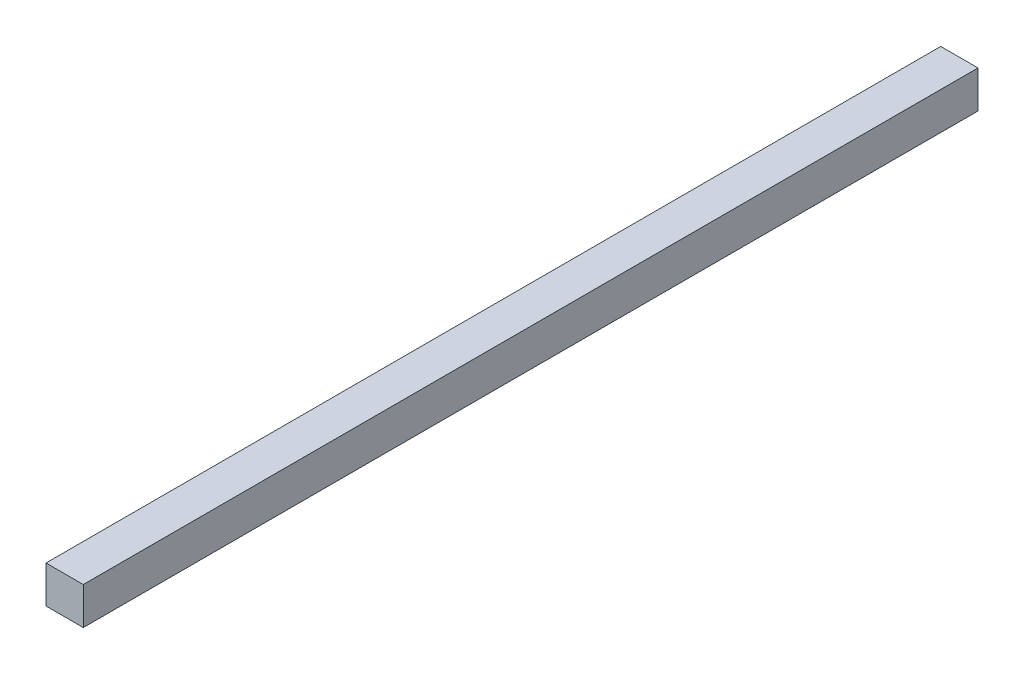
ISO-10303-21;
HEADER;
FILE_DESCRIPTION(('STEP AP214'),'2;1');
FILE_NAME('part.step','',(''),(''),'','','');
FILE_SCHEMA(('AUTOMOTIVE_DESIGN { 1 0 10303 214 1 1 1 1 }'));
ENDSEC;
DATA;
#1=APPLICATION_CONTEXT('core data for automotive mechanical design processes');
#2=APPLICATION_PROTOCOL_DEFINITION('international standard','automotive_design',2000,#1);
#3=PRODUCT_CONTEXT('',#1,'mechanical');
#4=PRODUCT('Part','Part','',(#3));
#5=PRODUCT_RELATED_PRODUCT_CATEGORY('part','',(#4));
#6=PRODUCT_DEFINITION_FORMATION('','',#4);
#7=PRODUCT_DEFINITION_CONTEXT('part definition',#1,'design');
#8=PRODUCT_DEFINITION('design','',#6,#7);
#9=PRODUCT_DEFINITION_SHAPE('','',#8);
#10=(LENGTH_UNIT() NAMED_UNIT(*) SI_UNIT(.MILLI.,.METRE.));
#11=(NAMED_UNIT(*) PLANE_ANGLE_UNIT() SI_UNIT($,.RADIAN.));
#12=(NAMED_UNIT(*) SI_UNIT($,.STERADIAN.) SOLID_ANGLE_UNIT());
#13=UNCERTAINTY_MEASURE_WITH_UNIT(LENGTH_MEASURE(1.E-05),#10,'distance_accuracy_value','');
#14=(GEOMETRIC_REPRESENTATION_CONTEXT(3) GLOBAL_UNCERTAINTY_ASSIGNED_CONTEXT((#13)) GLOBAL_UNIT_ASSIGNED_CONTEXT((#10,
#11,#12)) REPRESENTATION_CONTEXT('',''));
#15=CARTESIAN_POINT('',(0.,0.,0.));
#16=DIRECTION('',(0.,0.,1.));
#17=DIRECTION('',(1.,0.,0.));
#18=AXIS2_PLACEMENT_3D('',#15,#16,#17);
#19=CARTESIAN_POINT('',(0.,6.35,152.4));
#20=DIRECTION('',(1.,0.,0.));
#21=DIRECTION('',(0.,1.,0.));
#22=AXIS2_PLACEMENT_3D('',#19,#20,#21);
#23=PLANE('',#22);
#24=DIRECTION('',(0.,-1.,0.));
#25=VECTOR('',#24,1.);
#26=CARTESIAN_POINT('',(0.,6.35,0.));
#27=LINE('',#26,#25);
#28=CARTESIAN_POINT('',(0.,6.35,0.));
#29=VERTEX_POINT('',#28);
#30=CARTESIAN_POINT('',(0.,0.,0.));
#31=VERTEX_POINT('',#30);
#32=EDGE_CURVE('E75',#29,#31,#27,.T.);
#33=ORIENTED_EDGE('',*,*,#32,.T.);
#34=DIRECTION('',(0.,0.,-1.));
#35=VECTOR('',#34,1.);
#36=CARTESIAN_POINT('',(0.,0.,152.4));
#37=LINE('',#36,#35);
#38=CARTESIAN_POINT('',(0.,0.,152.4));
#39=VERTEX_POINT('',#38);
#40=EDGE_CURVE('E11',#39,#31,#37,.T.);
#41=ORIENTED_EDGE('',*,*,#40,.F.);
#42=DIRECTION('',(0.,-1.,0.));
#43=VECTOR('',#42,1.);
#44=CARTESIAN_POINT('',(0.,6.35,152.4));
#45=LINE('',#44,#43);
#46=CARTESIAN_POINT('',(0.,6.35,152.4));
#47=VERTEX_POINT('',#46);
#48=EDGE_CURVE('E93',#47,#39,#45,.T.);
#49=ORIENTED_EDGE('',*,*,#48,.F.);
#50=DIRECTION('',(0.,0.,-1.));
#51=VECTOR('',#50,1.);
#52=CARTESIAN_POINT('',(0.,6.35,152.4));
#53=LINE('',#52,#51);
#54=EDGE_CURVE('E87',#47,#29,#53,.T.);
#55=ORIENTED_EDGE('',*,*,#54,.T.);
#56=EDGE_LOOP('',(#33,#41,#49,#55));
#57=FACE_BOUND('',#56,.T.);
#58=ADVANCED_FACE('F31',(#57),#23,.F.);
#59=CARTESIAN_POINT('',(0.,0.,152.4));
#60=DIRECTION('',(0.,1.,0.));
#61=DIRECTION('',(0.,0.,1.));
#62=AXIS2_PLACEMENT_3D('',#59,#60,#61);
#63=PLANE('',#62);
#64=DIRECTION('',(1.,0.,0.));
#65=VECTOR('',#64,1.);
#66=CARTESIAN_POINT('',(0.,0.,0.));
#67=LINE('',#66,#65);
#68=CARTESIAN_POINT('',(6.35,0.,0.));
#69=VERTEX_POINT('',#68);
#70=EDGE_CURVE('E71',#31,#69,#67,.T.);
#71=ORIENTED_EDGE('',*,*,#70,.T.);
#72=DIRECTION('',(0.,0.,-1.));
#73=VECTOR('',#72,1.);
#74=CARTESIAN_POINT('',(6.35,0.,152.4));
#75=LINE('',#74,#73);
#76=CARTESIAN_POINT('',(6.35,0.,152.4));
#77=VERTEX_POINT('',#76);
#78=EDGE_CURVE('E38',#77,#69,#75,.T.);
#79=ORIENTED_EDGE('',*,*,#78,.F.);
#80=DIRECTION('',(1.,0.,0.));
#81=VECTOR('',#80,1.);
#82=CARTESIAN_POINT('',(0.,0.,152.4));
#83=LINE('',#82,#81);
#84=EDGE_CURVE('E83',#39,#77,#83,.T.);
#85=ORIENTED_EDGE('',*,*,#84,.F.);
#86=ORIENTED_EDGE('',*,*,#40,.T.);
#87=EDGE_LOOP('',(#71,#79,#85,#86));
#88=FACE_BOUND('',#87,.T.);
#89=ADVANCED_FACE('F82',(#88),#63,.F.);
#90=CARTESIAN_POINT('',(6.35,6.35,152.4));
#91=DIRECTION('',(-1.,0.,0.));
#92=DIRECTION('',(0.,-1.,0.));
#93=AXIS2_PLACEMENT_3D('',#90,#91,#92);
#94=PLANE('',#93);
#95=DIRECTION('',(0.,1.,0.));
#96=VECTOR('',#95,1.);
#97=CARTESIAN_POINT('',(6.35,6.35,0.));
#98=LINE('',#97,#96);
#99=CARTESIAN_POINT('',(6.35,6.35,0.));
#100=VERTEX_POINT('',#99);
#101=EDGE_CURVE('E76',#69,#100,#98,.T.);
#102=ORIENTED_EDGE('',*,*,#101,.T.);
#103=DIRECTION('',(0.,0.,-1.));
#104=VECTOR('',#103,1.);
#105=CARTESIAN_POINT('',(6.35,6.35,152.4));
#106=LINE('',#105,#104);
#107=CARTESIAN_POINT('',(6.35,6.35,152.4));
#108=VERTEX_POINT('',#107);
#109=EDGE_CURVE('E99',#108,#100,#106,.T.);
#110=ORIENTED_EDGE('',*,*,#109,.F.);
#111=DIRECTION('',(0.,1.,0.));
#112=VECTOR('',#111,1.);
#113=CARTESIAN_POINT('',(6.35,6.35,152.4));
#114=LINE('',#113,#112);
#115=EDGE_CURVE('E50',#77,#108,#114,.T.);
#116=ORIENTED_EDGE('',*,*,#115,.F.);
#117=ORIENTED_EDGE('',*,*,#78,.T.);
#118=EDGE_LOOP('',(#102,#110,#116,#117));
#119=FACE_BOUND('',#118,.T.);
#120=ADVANCED_FACE('F102',(#119),#94,.F.);
#121=CARTESIAN_POINT('',(0.,6.35,152.4));
#122=DIRECTION('',(0.,-1.,0.));
#123=DIRECTION('',(0.,0.,-1.));
#124=AXIS2_PLACEMENT_3D('',#121,#122,#123);
#125=PLANE('',#124);
#126=DIRECTION('',(-1.,0.,0.));
#127=VECTOR('',#126,1.);
#128=CARTESIAN_POINT('',(0.,6.35,0.));
#129=LINE('',#128,#127);
#130=EDGE_CURVE('E91',#100,#29,#129,.T.);
#131=ORIENTED_EDGE('',*,*,#130,.T.);
#132=ORIENTED_EDGE('',*,*,#54,.F.);
#133=DIRECTION('',(-1.,0.,0.));
#134=VECTOR('',#133,1.);
#135=CARTESIAN_POINT('',(0.,6.35,152.4));
#136=LINE('',#135,#134);
#137=EDGE_CURVE('E45',#108,#47,#136,.T.);
#138=ORIENTED_EDGE('',*,*,#137,.F.);
#139=ORIENTED_EDGE('',*,*,#109,.T.);
#140=EDGE_LOOP('',(#131,#132,#138,#139));
#141=FACE_BOUND('',#140,.T.);
#142=ADVANCED_FACE('F104',(#141),#125,.F.);
#143=CARTESIAN_POINT('',(0.,0.,152.4));
#144=DIRECTION('',(0.,0.,1.));
#145=DIRECTION('',(1.,0.,0.));
#146=AXIS2_PLACEMENT_3D('',#143,#144,#145);
#147=PLANE('',#146);
#148=ORIENTED_EDGE('',*,*,#48,.T.);
#149=ORIENTED_EDGE('',*,*,#84,.T.);
#150=ORIENTED_EDGE('',*,*,#115,.T.);
#151=ORIENTED_EDGE('',*,*,#137,.T.);
#152=EDGE_LOOP('',(#148,#149,#150,#151));
#153=FACE_BOUND('',#152,.T.);
#154=ADVANCED_FACE('F105',(#153),#147,.T.);
#155=CARTESIAN_POINT('',(0.,0.,0.));
#156=DIRECTION('',(0.,0.,1.));
#157=DIRECTION('',(1.,0.,0.));
#158=AXIS2_PLACEMENT_3D('',#155,#156,#157);
#159=PLANE('',#158);
#160=ORIENTED_EDGE('',*,*,#32,.F.);
#161=ORIENTED_EDGE('',*,*,#130,.F.);
#162=ORIENTED_EDGE('',*,*,#101,.F.);
#163=ORIENTED_EDGE('',*,*,#70,.F.);
#164=EDGE_LOOP('',(#160,#161,#162,#163));
#165=FACE_BOUND('',#164,.T.);
#166=ADVANCED_FACE('F72',(#165),#159,.F.);
#167=CLOSED_SHELL('',(#58,#89,#120,#142,#154,#166));
#168=MANIFOLD_SOLID_BREP('B2',#167);
#169=ADVANCED_BREP_SHAPE_REPRESENTATION('',(#18,#168),#14);
#170=SHAPE_DEFINITION_REPRESENTATION(#9,#169);
ENDSEC;
END-ISO-10303-21;
